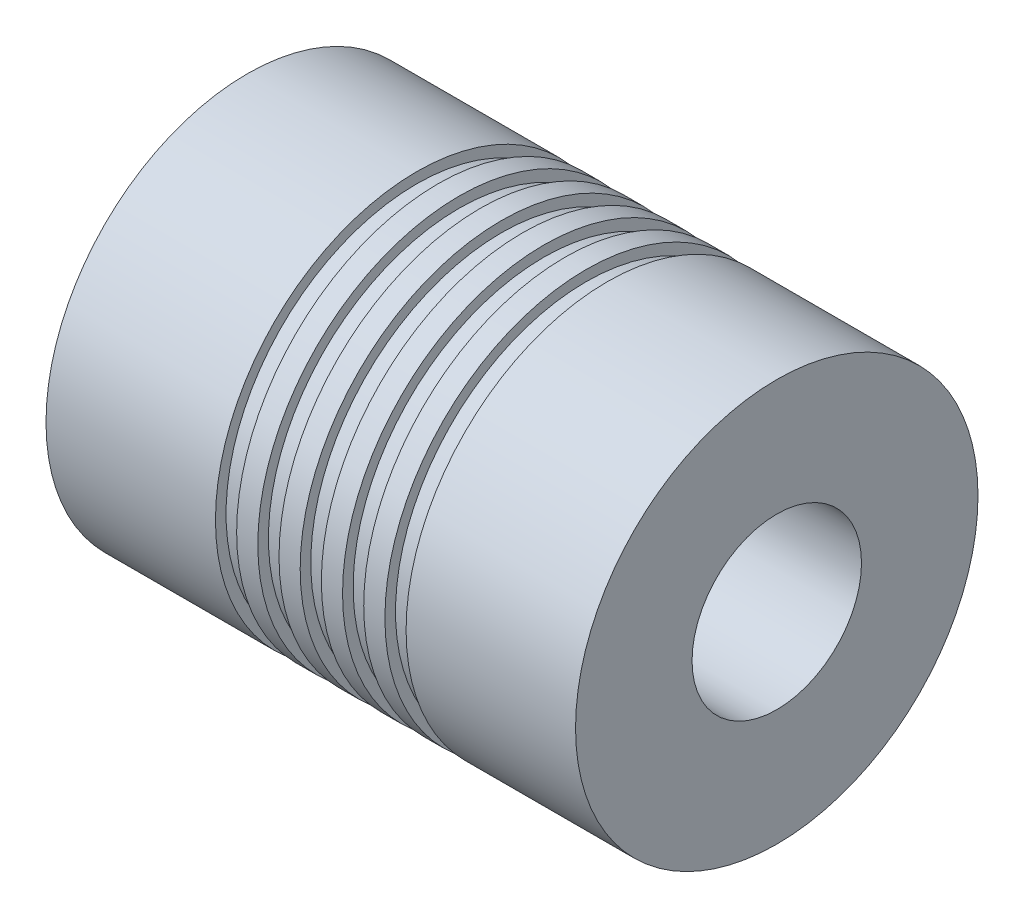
ISO-10303-21;
HEADER;
FILE_DESCRIPTION(('STEP AP214'),'2;1');
FILE_NAME('part.step','',(''),(''),'','','');
FILE_SCHEMA(('AUTOMOTIVE_DESIGN { 1 0 10303 214 1 1 1 1 }'));
ENDSEC;
DATA;
#1=APPLICATION_CONTEXT('core data for automotive mechanical design processes');
#2=APPLICATION_PROTOCOL_DEFINITION('international standard','automotive_design',2000,#1);
#3=PRODUCT_CONTEXT('',#1,'mechanical');
#4=PRODUCT('Part','Part','',(#3));
#5=PRODUCT_RELATED_PRODUCT_CATEGORY('part','',(#4));
#6=PRODUCT_DEFINITION_FORMATION('','',#4);
#7=PRODUCT_DEFINITION_CONTEXT('part definition',#1,'design');
#8=PRODUCT_DEFINITION('design','',#6,#7);
#9=PRODUCT_DEFINITION_SHAPE('','',#8);
#10=(LENGTH_UNIT() NAMED_UNIT(*) SI_UNIT(.MILLI.,.METRE.));
#11=(NAMED_UNIT(*) PLANE_ANGLE_UNIT() SI_UNIT($,.RADIAN.));
#12=(NAMED_UNIT(*) SI_UNIT($,.STERADIAN.) SOLID_ANGLE_UNIT());
#13=UNCERTAINTY_MEASURE_WITH_UNIT(LENGTH_MEASURE(1.E-05),#10,'distance_accuracy_value','');
#14=(GEOMETRIC_REPRESENTATION_CONTEXT(3) GLOBAL_UNCERTAINTY_ASSIGNED_CONTEXT((#13)) GLOBAL_UNIT_ASSIGNED_CONTEXT((#10,
#11,#12)) REPRESENTATION_CONTEXT('',''));
#15=CARTESIAN_POINT('',(0.,0.,0.));
#16=DIRECTION('',(0.,0.,1.));
#17=DIRECTION('',(1.,0.,0.));
#18=AXIS2_PLACEMENT_3D('',#15,#16,#17);
#19=CARTESIAN_POINT('',(-12.5,0.,0.));
#20=DIRECTION('',(-1.,0.,0.));
#21=DIRECTION('',(0.,-1.,0.));
#22=AXIS2_PLACEMENT_3D('',#19,#20,#21);
#23=CYLINDRICAL_SURFACE('',#22,2.5);
#24=CARTESIAN_POINT('',(0.,0.,0.));
#25=DIRECTION('',(-1.,0.,0.));
#26=DIRECTION('',(0.,-1.,0.));
#27=AXIS2_PLACEMENT_3D('',#24,#25,#26);
#28=CIRCLE('',#27,2.5);
#29=CARTESIAN_POINT('',(0.,-2.5,0.));
#30=VERTEX_POINT('',#29);
#31=EDGE_CURVE('E115',#30,#30,#28,.T.);
#32=ORIENTED_EDGE('',*,*,#31,.F.);
#33=EDGE_LOOP('',(#32));
#34=FACE_BOUND('',#33,.T.);
#35=CARTESIAN_POINT('',(-12.5,0.,0.));
#36=DIRECTION('',(-1.,0.,0.));
#37=DIRECTION('',(0.,-1.,0.));
#38=AXIS2_PLACEMENT_3D('',#35,#36,#37);
#39=CIRCLE('',#38,2.5);
#40=CARTESIAN_POINT('',(-12.5,-2.5,0.));
#41=VERTEX_POINT('',#40);
#42=EDGE_CURVE('E10',#41,#41,#39,.T.);
#43=ORIENTED_EDGE('',*,*,#42,.T.);
#44=EDGE_LOOP('',(#43));
#45=FACE_BOUND('',#44,.T.);
#46=ADVANCED_FACE('F33',(#34,#45),#23,.F.);
#47=CARTESIAN_POINT('',(-12.5,2.5,0.));
#48=DIRECTION('',(1.,0.,0.));
#49=DIRECTION('',(0.,1.,0.));
#50=AXIS2_PLACEMENT_3D('',#47,#48,#49);
#51=PLANE('',#50);
#52=ORIENTED_EDGE('',*,*,#42,.F.);
#53=EDGE_LOOP('',(#52));
#54=FACE_BOUND('',#53,.T.);
#55=CARTESIAN_POINT('',(-12.5,0.,0.));
#56=DIRECTION('',(-1.,0.,0.));
#57=DIRECTION('',(0.,-1.,0.));
#58=AXIS2_PLACEMENT_3D('',#55,#56,#57);
#59=CIRCLE('',#58,9.5);
#60=CARTESIAN_POINT('',(-12.5,-9.5,0.));
#61=VERTEX_POINT('',#60);
#62=EDGE_CURVE('E39',#61,#61,#59,.T.);
#63=ORIENTED_EDGE('',*,*,#62,.T.);
#64=EDGE_LOOP('',(#63));
#65=FACE_BOUND('',#64,.T.);
#66=ADVANCED_FACE('F122',(#54,#65),#51,.F.);
#67=CARTESIAN_POINT('',(-12.5,0.,0.));
#68=DIRECTION('',(-1.,0.,0.));
#69=DIRECTION('',(0.,-1.,0.));
#70=AXIS2_PLACEMENT_3D('',#67,#68,#69);
#71=CYLINDRICAL_SURFACE('',#70,9.5);
#72=ORIENTED_EDGE('',*,*,#62,.F.);
#73=EDGE_LOOP('',(#72));
#74=FACE_BOUND('',#73,.T.);
#75=CARTESIAN_POINT('',(-4.5,0.,0.));
#76=DIRECTION('',(-1.,0.,0.));
#77=DIRECTION('',(0.,-1.,0.));
#78=AXIS2_PLACEMENT_3D('',#75,#76,#77);
#79=CIRCLE('',#78,9.5);
#80=CARTESIAN_POINT('',(-4.5,-9.5,0.));
#81=VERTEX_POINT('',#80);
#82=EDGE_CURVE('E43',#81,#81,#79,.T.);
#83=ORIENTED_EDGE('',*,*,#82,.T.);
#84=EDGE_LOOP('',(#83));
#85=FACE_BOUND('',#84,.T.);
#86=ADVANCED_FACE('F126',(#74,#85),#71,.T.);
#87=CARTESIAN_POINT('',(-4.5,9.5,0.));
#88=DIRECTION('',(-1.,0.,0.));
#89=DIRECTION('',(0.,-1.,0.));
#90=AXIS2_PLACEMENT_3D('',#87,#88,#89);
#91=PLANE('',#90);
#92=ORIENTED_EDGE('',*,*,#82,.F.);
#93=EDGE_LOOP('',(#92));
#94=FACE_BOUND('',#93,.T.);
#95=CARTESIAN_POINT('',(-4.5,0.,0.));
#96=DIRECTION('',(-1.,0.,0.));
#97=DIRECTION('',(0.,-1.,0.));
#98=AXIS2_PLACEMENT_3D('',#95,#96,#97);
#99=CIRCLE('',#98,9.);
#100=CARTESIAN_POINT('',(-4.5,-9.,0.));
#101=VERTEX_POINT('',#100);
#102=EDGE_CURVE('E47',#101,#101,#99,.T.);
#103=ORIENTED_EDGE('',*,*,#102,.T.);
#104=EDGE_LOOP('',(#103));
#105=FACE_BOUND('',#104,.T.);
#106=ADVANCED_FACE('F131',(#94,#105),#91,.F.);
#107=CARTESIAN_POINT('',(-12.5,0.,0.));
#108=DIRECTION('',(-1.,0.,0.));
#109=DIRECTION('',(0.,-1.,0.));
#110=AXIS2_PLACEMENT_3D('',#107,#108,#109);
#111=CYLINDRICAL_SURFACE('',#110,9.);
#112=ORIENTED_EDGE('',*,*,#102,.F.);
#113=EDGE_LOOP('',(#112));
#114=FACE_BOUND('',#113,.T.);
#115=CARTESIAN_POINT('',(-3.5,0.,0.));
#116=DIRECTION('',(-1.,0.,0.));
#117=DIRECTION('',(0.,-1.,0.));
#118=AXIS2_PLACEMENT_3D('',#115,#116,#117);
#119=CIRCLE('',#118,9.);
#120=CARTESIAN_POINT('',(-3.5,-9.,0.));
#121=VERTEX_POINT('',#120);
#122=EDGE_CURVE('E52',#121,#121,#119,.T.);
#123=ORIENTED_EDGE('',*,*,#122,.T.);
#124=EDGE_LOOP('',(#123));
#125=FACE_BOUND('',#124,.T.);
#126=ADVANCED_FACE('F137',(#114,#125),#111,.T.);
#127=CARTESIAN_POINT('',(-3.5,9.,0.));
#128=DIRECTION('',(1.,0.,0.));
#129=DIRECTION('',(0.,1.,0.));
#130=AXIS2_PLACEMENT_3D('',#127,#128,#129);
#131=PLANE('',#130);
#132=ORIENTED_EDGE('',*,*,#122,.F.);
#133=EDGE_LOOP('',(#132));
#134=FACE_BOUND('',#133,.T.);
#135=CARTESIAN_POINT('',(-3.5,0.,0.));
#136=DIRECTION('',(-1.,0.,0.));
#137=DIRECTION('',(0.,-1.,0.));
#138=AXIS2_PLACEMENT_3D('',#135,#136,#137);
#139=CIRCLE('',#138,9.5);
#140=CARTESIAN_POINT('',(-3.5,-9.5,0.));
#141=VERTEX_POINT('',#140);
#142=EDGE_CURVE('E55',#141,#141,#139,.T.);
#143=ORIENTED_EDGE('',*,*,#142,.T.);
#144=EDGE_LOOP('',(#143));
#145=FACE_BOUND('',#144,.T.);
#146=ADVANCED_FACE('F141',(#134,#145),#131,.F.);
#147=CARTESIAN_POINT('',(-12.5,0.,0.));
#148=DIRECTION('',(-1.,0.,0.));
#149=DIRECTION('',(0.,-1.,0.));
#150=AXIS2_PLACEMENT_3D('',#147,#148,#149);
#151=CYLINDRICAL_SURFACE('',#150,9.5);
#152=ORIENTED_EDGE('',*,*,#142,.F.);
#153=EDGE_LOOP('',(#152));
#154=FACE_BOUND('',#153,.T.);
#155=CARTESIAN_POINT('',(-2.5,0.,0.));
#156=DIRECTION('',(-1.,0.,0.));
#157=DIRECTION('',(0.,-1.,0.));
#158=AXIS2_PLACEMENT_3D('',#155,#156,#157);
#159=CIRCLE('',#158,9.5);
#160=CARTESIAN_POINT('',(-2.5,-9.5,0.));
#161=VERTEX_POINT('',#160);
#162=EDGE_CURVE('E58',#161,#161,#159,.T.);
#163=ORIENTED_EDGE('',*,*,#162,.T.);
#164=EDGE_LOOP('',(#163));
#165=FACE_BOUND('',#164,.T.);
#166=ADVANCED_FACE('F145',(#154,#165),#151,.T.);
#167=CARTESIAN_POINT('',(-2.5,9.5,0.));
#168=DIRECTION('',(-1.,0.,0.));
#169=DIRECTION('',(0.,-1.,0.));
#170=AXIS2_PLACEMENT_3D('',#167,#168,#169);
#171=PLANE('',#170);
#172=ORIENTED_EDGE('',*,*,#162,.F.);
#173=EDGE_LOOP('',(#172));
#174=FACE_BOUND('',#173,.T.);
#175=CARTESIAN_POINT('',(-2.5,0.,0.));
#176=DIRECTION('',(-1.,0.,0.));
#177=DIRECTION('',(0.,-1.,0.));
#178=AXIS2_PLACEMENT_3D('',#175,#176,#177);
#179=CIRCLE('',#178,9.);
#180=CARTESIAN_POINT('',(-2.5,-9.,0.));
#181=VERTEX_POINT('',#180);
#182=EDGE_CURVE('E61',#181,#181,#179,.T.);
#183=ORIENTED_EDGE('',*,*,#182,.T.);
#184=EDGE_LOOP('',(#183));
#185=FACE_BOUND('',#184,.T.);
#186=ADVANCED_FACE('F149',(#174,#185),#171,.F.);
#187=CARTESIAN_POINT('',(-12.5,0.,0.));
#188=DIRECTION('',(-1.,0.,0.));
#189=DIRECTION('',(0.,-1.,0.));
#190=AXIS2_PLACEMENT_3D('',#187,#188,#189);
#191=CYLINDRICAL_SURFACE('',#190,9.);
#192=ORIENTED_EDGE('',*,*,#182,.F.);
#193=EDGE_LOOP('',(#192));
#194=FACE_BOUND('',#193,.T.);
#195=CARTESIAN_POINT('',(-1.5,0.,0.));
#196=DIRECTION('',(-1.,0.,0.));
#197=DIRECTION('',(0.,-1.,0.));
#198=AXIS2_PLACEMENT_3D('',#195,#196,#197);
#199=CIRCLE('',#198,9.);
#200=CARTESIAN_POINT('',(-1.5,-9.,0.));
#201=VERTEX_POINT('',#200);
#202=EDGE_CURVE('E64',#201,#201,#199,.T.);
#203=ORIENTED_EDGE('',*,*,#202,.T.);
#204=EDGE_LOOP('',(#203));
#205=FACE_BOUND('',#204,.T.);
#206=ADVANCED_FACE('F153',(#194,#205),#191,.T.);
#207=CARTESIAN_POINT('',(-1.5,9.,0.));
#208=DIRECTION('',(1.,0.,0.));
#209=DIRECTION('',(0.,1.,0.));
#210=AXIS2_PLACEMENT_3D('',#207,#208,#209);
#211=PLANE('',#210);
#212=ORIENTED_EDGE('',*,*,#202,.F.);
#213=EDGE_LOOP('',(#212));
#214=FACE_BOUND('',#213,.T.);
#215=CARTESIAN_POINT('',(-1.5,0.,0.));
#216=DIRECTION('',(-1.,0.,0.));
#217=DIRECTION('',(0.,-1.,0.));
#218=AXIS2_PLACEMENT_3D('',#215,#216,#217);
#219=CIRCLE('',#218,9.5);
#220=CARTESIAN_POINT('',(-1.5,-9.5,0.));
#221=VERTEX_POINT('',#220);
#222=EDGE_CURVE('E67',#221,#221,#219,.T.);
#223=ORIENTED_EDGE('',*,*,#222,.T.);
#224=EDGE_LOOP('',(#223));
#225=FACE_BOUND('',#224,.T.);
#226=ADVANCED_FACE('F157',(#214,#225),#211,.F.);
#227=CARTESIAN_POINT('',(-12.5,0.,0.));
#228=DIRECTION('',(-1.,0.,0.));
#229=DIRECTION('',(0.,-1.,0.));
#230=AXIS2_PLACEMENT_3D('',#227,#228,#229);
#231=CYLINDRICAL_SURFACE('',#230,9.5);
#232=ORIENTED_EDGE('',*,*,#222,.F.);
#233=EDGE_LOOP('',(#232));
#234=FACE_BOUND('',#233,.T.);
#235=CARTESIAN_POINT('',(-0.499999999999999,0.,0.));
#236=DIRECTION('',(-1.,0.,0.));
#237=DIRECTION('',(0.,-1.,0.));
#238=AXIS2_PLACEMENT_3D('',#235,#236,#237);
#239=CIRCLE('',#238,9.5);
#240=CARTESIAN_POINT('',(-0.499999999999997,-9.5,0.));
#241=VERTEX_POINT('',#240);
#242=EDGE_CURVE('E70',#241,#241,#239,.T.);
#243=ORIENTED_EDGE('',*,*,#242,.T.);
#244=EDGE_LOOP('',(#243));
#245=FACE_BOUND('',#244,.T.);
#246=ADVANCED_FACE('F161',(#234,#245),#231,.T.);
#247=CARTESIAN_POINT('',(-0.500000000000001,9.5,0.));
#248=DIRECTION('',(-1.,0.,0.));
#249=DIRECTION('',(0.,-1.,0.));
#250=AXIS2_PLACEMENT_3D('',#247,#248,#249);
#251=PLANE('',#250);
#252=ORIENTED_EDGE('',*,*,#242,.F.);
#253=EDGE_LOOP('',(#252));
#254=FACE_BOUND('',#253,.T.);
#255=CARTESIAN_POINT('',(-0.499999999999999,0.,0.));
#256=DIRECTION('',(-1.,0.,0.));
#257=DIRECTION('',(0.,-1.,0.));
#258=AXIS2_PLACEMENT_3D('',#255,#256,#257);
#259=CIRCLE('',#258,9.);
#260=CARTESIAN_POINT('',(-0.499999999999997,-8.99999999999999,0.));
#261=VERTEX_POINT('',#260);
#262=EDGE_CURVE('E73',#261,#261,#259,.T.);
#263=ORIENTED_EDGE('',*,*,#262,.T.);
#264=EDGE_LOOP('',(#263));
#265=FACE_BOUND('',#264,.T.);
#266=ADVANCED_FACE('F165',(#254,#265),#251,.F.);
#267=CARTESIAN_POINT('',(-12.5,0.,0.));
#268=DIRECTION('',(-1.,0.,0.));
#269=DIRECTION('',(0.,-1.,0.));
#270=AXIS2_PLACEMENT_3D('',#267,#268,#269);
#271=CYLINDRICAL_SURFACE('',#270,9.);
#272=ORIENTED_EDGE('',*,*,#262,.F.);
#273=EDGE_LOOP('',(#272));
#274=FACE_BOUND('',#273,.T.);
#275=CARTESIAN_POINT('',(0.5,0.,0.));
#276=DIRECTION('',(-1.,0.,0.));
#277=DIRECTION('',(0.,-1.,0.));
#278=AXIS2_PLACEMENT_3D('',#275,#276,#277);
#279=CIRCLE('',#278,9.);
#280=CARTESIAN_POINT('',(0.500000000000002,-8.99999999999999,0.));
#281=VERTEX_POINT('',#280);
#282=EDGE_CURVE('E76',#281,#281,#279,.T.);
#283=ORIENTED_EDGE('',*,*,#282,.T.);
#284=EDGE_LOOP('',(#283));
#285=FACE_BOUND('',#284,.T.);
#286=ADVANCED_FACE('F169',(#274,#285),#271,.T.);
#287=CARTESIAN_POINT('',(0.499999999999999,9.,0.));
#288=DIRECTION('',(1.,0.,0.));
#289=DIRECTION('',(0.,1.,0.));
#290=AXIS2_PLACEMENT_3D('',#287,#288,#289);
#291=PLANE('',#290);
#292=ORIENTED_EDGE('',*,*,#282,.F.);
#293=EDGE_LOOP('',(#292));
#294=FACE_BOUND('',#293,.T.);
#295=CARTESIAN_POINT('',(0.5,0.,0.));
#296=DIRECTION('',(-1.,0.,0.));
#297=DIRECTION('',(0.,-1.,0.));
#298=AXIS2_PLACEMENT_3D('',#295,#296,#297);
#299=CIRCLE('',#298,9.5);
#300=CARTESIAN_POINT('',(0.500000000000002,-9.5,0.));
#301=VERTEX_POINT('',#300);
#302=EDGE_CURVE('E79',#301,#301,#299,.T.);
#303=ORIENTED_EDGE('',*,*,#302,.T.);
#304=EDGE_LOOP('',(#303));
#305=FACE_BOUND('',#304,.T.);
#306=ADVANCED_FACE('F173',(#294,#305),#291,.F.);
#307=CARTESIAN_POINT('',(-12.5,0.,0.));
#308=DIRECTION('',(-1.,0.,0.));
#309=DIRECTION('',(0.,-1.,0.));
#310=AXIS2_PLACEMENT_3D('',#307,#308,#309);
#311=CYLINDRICAL_SURFACE('',#310,9.5);
#312=ORIENTED_EDGE('',*,*,#302,.F.);
#313=EDGE_LOOP('',(#312));
#314=FACE_BOUND('',#313,.T.);
#315=CARTESIAN_POINT('',(1.5,0.,0.));
#316=DIRECTION('',(-1.,0.,0.));
#317=DIRECTION('',(0.,-1.,0.));
#318=AXIS2_PLACEMENT_3D('',#315,#316,#317);
#319=CIRCLE('',#318,9.5);
#320=CARTESIAN_POINT('',(1.5,-9.5,0.));
#321=VERTEX_POINT('',#320);
#322=EDGE_CURVE('E82',#321,#321,#319,.T.);
#323=ORIENTED_EDGE('',*,*,#322,.T.);
#324=EDGE_LOOP('',(#323));
#325=FACE_BOUND('',#324,.T.);
#326=ADVANCED_FACE('F177',(#314,#325),#311,.T.);
#327=CARTESIAN_POINT('',(1.5,9.5,0.));
#328=DIRECTION('',(-1.,0.,0.));
#329=DIRECTION('',(0.,-1.,0.));
#330=AXIS2_PLACEMENT_3D('',#327,#328,#329);
#331=PLANE('',#330);
#332=ORIENTED_EDGE('',*,*,#322,.F.);
#333=EDGE_LOOP('',(#332));
#334=FACE_BOUND('',#333,.T.);
#335=CARTESIAN_POINT('',(1.5,0.,0.));
#336=DIRECTION('',(-1.,0.,0.));
#337=DIRECTION('',(0.,-1.,0.));
#338=AXIS2_PLACEMENT_3D('',#335,#336,#337);
#339=CIRCLE('',#338,9.);
#340=CARTESIAN_POINT('',(1.5,-8.99999999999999,0.));
#341=VERTEX_POINT('',#340);
#342=EDGE_CURVE('E85',#341,#341,#339,.T.);
#343=ORIENTED_EDGE('',*,*,#342,.T.);
#344=EDGE_LOOP('',(#343));
#345=FACE_BOUND('',#344,.T.);
#346=ADVANCED_FACE('F181',(#334,#345),#331,.F.);
#347=CARTESIAN_POINT('',(-12.5,0.,0.));
#348=DIRECTION('',(-1.,0.,0.));
#349=DIRECTION('',(0.,-1.,0.));
#350=AXIS2_PLACEMENT_3D('',#347,#348,#349);
#351=CYLINDRICAL_SURFACE('',#350,8.99999999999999);
#352=ORIENTED_EDGE('',*,*,#342,.F.);
#353=EDGE_LOOP('',(#352));
#354=FACE_BOUND('',#353,.T.);
#355=CARTESIAN_POINT('',(2.5,0.,0.));
#356=DIRECTION('',(-1.,0.,0.));
#357=DIRECTION('',(0.,-1.,0.));
#358=AXIS2_PLACEMENT_3D('',#355,#356,#357);
#359=CIRCLE('',#358,8.99999999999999);
#360=CARTESIAN_POINT('',(2.5,-8.99999999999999,0.));
#361=VERTEX_POINT('',#360);
#362=EDGE_CURVE('E88',#361,#361,#359,.T.);
#363=ORIENTED_EDGE('',*,*,#362,.T.);
#364=EDGE_LOOP('',(#363));
#365=FACE_BOUND('',#364,.T.);
#366=ADVANCED_FACE('F185',(#354,#365),#351,.T.);
#367=CARTESIAN_POINT('',(2.5,9.,0.));
#368=DIRECTION('',(1.,0.,0.));
#369=DIRECTION('',(0.,1.,0.));
#370=AXIS2_PLACEMENT_3D('',#367,#368,#369);
#371=PLANE('',#370);
#372=ORIENTED_EDGE('',*,*,#362,.F.);
#373=EDGE_LOOP('',(#372));
#374=FACE_BOUND('',#373,.T.);
#375=CARTESIAN_POINT('',(2.5,0.,0.));
#376=DIRECTION('',(-1.,0.,0.));
#377=DIRECTION('',(0.,-1.,0.));
#378=AXIS2_PLACEMENT_3D('',#375,#376,#377);
#379=CIRCLE('',#378,9.5);
#380=CARTESIAN_POINT('',(2.5,-9.49999999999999,0.));
#381=VERTEX_POINT('',#380);
#382=EDGE_CURVE('E91',#381,#381,#379,.T.);
#383=ORIENTED_EDGE('',*,*,#382,.T.);
#384=EDGE_LOOP('',(#383));
#385=FACE_BOUND('',#384,.T.);
#386=ADVANCED_FACE('F189',(#374,#385),#371,.F.);
#387=CARTESIAN_POINT('',(-12.5,0.,0.));
#388=DIRECTION('',(-1.,0.,0.));
#389=DIRECTION('',(0.,-1.,0.));
#390=AXIS2_PLACEMENT_3D('',#387,#388,#389);
#391=CYLINDRICAL_SURFACE('',#390,9.5);
#392=ORIENTED_EDGE('',*,*,#382,.F.);
#393=EDGE_LOOP('',(#392));
#394=FACE_BOUND('',#393,.T.);
#395=CARTESIAN_POINT('',(3.5,0.,0.));
#396=DIRECTION('',(-1.,0.,0.));
#397=DIRECTION('',(0.,-1.,0.));
#398=AXIS2_PLACEMENT_3D('',#395,#396,#397);
#399=CIRCLE('',#398,9.5);
#400=CARTESIAN_POINT('',(3.5,-9.49999999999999,0.));
#401=VERTEX_POINT('',#400);
#402=EDGE_CURVE('E94',#401,#401,#399,.T.);
#403=ORIENTED_EDGE('',*,*,#402,.T.);
#404=EDGE_LOOP('',(#403));
#405=FACE_BOUND('',#404,.T.);
#406=ADVANCED_FACE('F193',(#394,#405),#391,.T.);
#407=CARTESIAN_POINT('',(3.5,9.5,0.));
#408=DIRECTION('',(-1.,0.,0.));
#409=DIRECTION('',(0.,-1.,0.));
#410=AXIS2_PLACEMENT_3D('',#407,#408,#409);
#411=PLANE('',#410);
#412=ORIENTED_EDGE('',*,*,#402,.F.);
#413=EDGE_LOOP('',(#412));
#414=FACE_BOUND('',#413,.T.);
#415=CARTESIAN_POINT('',(3.5,0.,0.));
#416=DIRECTION('',(-1.,0.,0.));
#417=DIRECTION('',(0.,-1.,0.));
#418=AXIS2_PLACEMENT_3D('',#415,#416,#417);
#419=CIRCLE('',#418,9.);
#420=CARTESIAN_POINT('',(3.5,-8.99999999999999,0.));
#421=VERTEX_POINT('',#420);
#422=EDGE_CURVE('E97',#421,#421,#419,.T.);
#423=ORIENTED_EDGE('',*,*,#422,.T.);
#424=EDGE_LOOP('',(#423));
#425=FACE_BOUND('',#424,.T.);
#426=ADVANCED_FACE('F197',(#414,#425),#411,.F.);
#427=CARTESIAN_POINT('',(-12.5,0.,0.));
#428=DIRECTION('',(-1.,0.,0.));
#429=DIRECTION('',(0.,-1.,0.));
#430=AXIS2_PLACEMENT_3D('',#427,#428,#429);
#431=CYLINDRICAL_SURFACE('',#430,9.);
#432=ORIENTED_EDGE('',*,*,#422,.F.);
#433=EDGE_LOOP('',(#432));
#434=FACE_BOUND('',#433,.T.);
#435=CARTESIAN_POINT('',(4.5,0.,0.));
#436=DIRECTION('',(-1.,0.,0.));
#437=DIRECTION('',(0.,-1.,0.));
#438=AXIS2_PLACEMENT_3D('',#435,#436,#437);
#439=CIRCLE('',#438,9.);
#440=CARTESIAN_POINT('',(4.5,-8.99999999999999,0.));
#441=VERTEX_POINT('',#440);
#442=EDGE_CURVE('E100',#441,#441,#439,.T.);
#443=ORIENTED_EDGE('',*,*,#442,.T.);
#444=EDGE_LOOP('',(#443));
#445=FACE_BOUND('',#444,.T.);
#446=ADVANCED_FACE('F201',(#434,#445),#431,.T.);
#447=CARTESIAN_POINT('',(4.5,9.,0.));
#448=DIRECTION('',(1.,0.,0.));
#449=DIRECTION('',(0.,1.,0.));
#450=AXIS2_PLACEMENT_3D('',#447,#448,#449);
#451=PLANE('',#450);
#452=ORIENTED_EDGE('',*,*,#442,.F.);
#453=EDGE_LOOP('',(#452));
#454=FACE_BOUND('',#453,.T.);
#455=CARTESIAN_POINT('',(4.5,0.,0.));
#456=DIRECTION('',(-1.,0.,0.));
#457=DIRECTION('',(0.,-1.,0.));
#458=AXIS2_PLACEMENT_3D('',#455,#456,#457);
#459=CIRCLE('',#458,9.5);
#460=CARTESIAN_POINT('',(4.5,-9.49999999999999,0.));
#461=VERTEX_POINT('',#460);
#462=EDGE_CURVE('E103',#461,#461,#459,.T.);
#463=ORIENTED_EDGE('',*,*,#462,.T.);
#464=EDGE_LOOP('',(#463));
#465=FACE_BOUND('',#464,.T.);
#466=ADVANCED_FACE('F205',(#454,#465),#451,.F.);
#467=CARTESIAN_POINT('',(-12.5,0.,0.));
#468=DIRECTION('',(-1.,0.,0.));
#469=DIRECTION('',(0.,-1.,0.));
#470=AXIS2_PLACEMENT_3D('',#467,#468,#469);
#471=CYLINDRICAL_SURFACE('',#470,9.49999999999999);
#472=ORIENTED_EDGE('',*,*,#462,.F.);
#473=EDGE_LOOP('',(#472));
#474=FACE_BOUND('',#473,.T.);
#475=CARTESIAN_POINT('',(12.5,0.,0.));
#476=DIRECTION('',(-1.,0.,0.));
#477=DIRECTION('',(0.,-1.,0.));
#478=AXIS2_PLACEMENT_3D('',#475,#476,#477);
#479=CIRCLE('',#478,9.49999999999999);
#480=CARTESIAN_POINT('',(12.5,-9.49999999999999,0.));
#481=VERTEX_POINT('',#480);
#482=EDGE_CURVE('E106',#481,#481,#479,.T.);
#483=ORIENTED_EDGE('',*,*,#482,.T.);
#484=EDGE_LOOP('',(#483));
#485=FACE_BOUND('',#484,.T.);
#486=ADVANCED_FACE('F209',(#474,#485),#471,.T.);
#487=CARTESIAN_POINT('',(12.5,9.5,0.));
#488=DIRECTION('',(-1.,0.,0.));
#489=DIRECTION('',(0.,-1.,0.));
#490=AXIS2_PLACEMENT_3D('',#487,#488,#489);
#491=PLANE('',#490);
#492=ORIENTED_EDGE('',*,*,#482,.F.);
#493=EDGE_LOOP('',(#492));
#494=FACE_BOUND('',#493,.T.);
#495=CARTESIAN_POINT('',(12.5,0.,0.));
#496=DIRECTION('',(-1.,0.,0.));
#497=DIRECTION('',(0.,-1.,0.));
#498=AXIS2_PLACEMENT_3D('',#495,#496,#497);
#499=CIRCLE('',#498,4.);
#500=CARTESIAN_POINT('',(12.5,-3.99999999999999,0.));
#501=VERTEX_POINT('',#500);
#502=EDGE_CURVE('E109',#501,#501,#499,.T.);
#503=ORIENTED_EDGE('',*,*,#502,.T.);
#504=EDGE_LOOP('',(#503));
#505=FACE_BOUND('',#504,.T.);
#506=ADVANCED_FACE('F213',(#494,#505),#491,.F.);
#507=CARTESIAN_POINT('',(-12.5,0.,0.));
#508=DIRECTION('',(-1.,0.,0.));
#509=DIRECTION('',(0.,-1.,0.));
#510=AXIS2_PLACEMENT_3D('',#507,#508,#509);
#511=CYLINDRICAL_SURFACE('',#510,4.);
#512=ORIENTED_EDGE('',*,*,#502,.F.);
#513=EDGE_LOOP('',(#512));
#514=FACE_BOUND('',#513,.T.);
#515=CARTESIAN_POINT('',(0.,0.,0.));
#516=DIRECTION('',(-1.,0.,0.));
#517=DIRECTION('',(0.,-1.,0.));
#518=AXIS2_PLACEMENT_3D('',#515,#516,#517);
#519=CIRCLE('',#518,4.);
#520=CARTESIAN_POINT('',(0.,-3.99999999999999,0.));
#521=VERTEX_POINT('',#520);
#522=EDGE_CURVE('E112',#521,#521,#519,.T.);
#523=ORIENTED_EDGE('',*,*,#522,.T.);
#524=EDGE_LOOP('',(#523));
#525=FACE_BOUND('',#524,.T.);
#526=ADVANCED_FACE('F217',(#514,#525),#511,.F.);
#527=CARTESIAN_POINT('',(0.,4.,0.));
#528=DIRECTION('',(-1.,0.,0.));
#529=DIRECTION('',(0.,-1.,0.));
#530=AXIS2_PLACEMENT_3D('',#527,#528,#529);
#531=PLANE('',#530);
#532=ORIENTED_EDGE('',*,*,#522,.F.);
#533=EDGE_LOOP('',(#532));
#534=FACE_BOUND('',#533,.T.);
#535=ORIENTED_EDGE('',*,*,#31,.T.);
#536=EDGE_LOOP('',(#535));
#537=FACE_BOUND('',#536,.T.);
#538=ADVANCED_FACE('F119',(#534,#537),#531,.F.);
#539=CLOSED_SHELL('',(#46,#66,#86,#106,#126,#146,#166,#186,#206,#226,#246,#266,#286,#306,#326,
#346,#366,#386,#406,#426,#446,#466,#486,#506,#526,#538));
#540=MANIFOLD_SOLID_BREP('B2',#539);
#541=ADVANCED_BREP_SHAPE_REPRESENTATION('',(#18,#540),#14);
#542=SHAPE_DEFINITION_REPRESENTATION(#9,#541);
ENDSEC;
END-ISO-10303-21;
